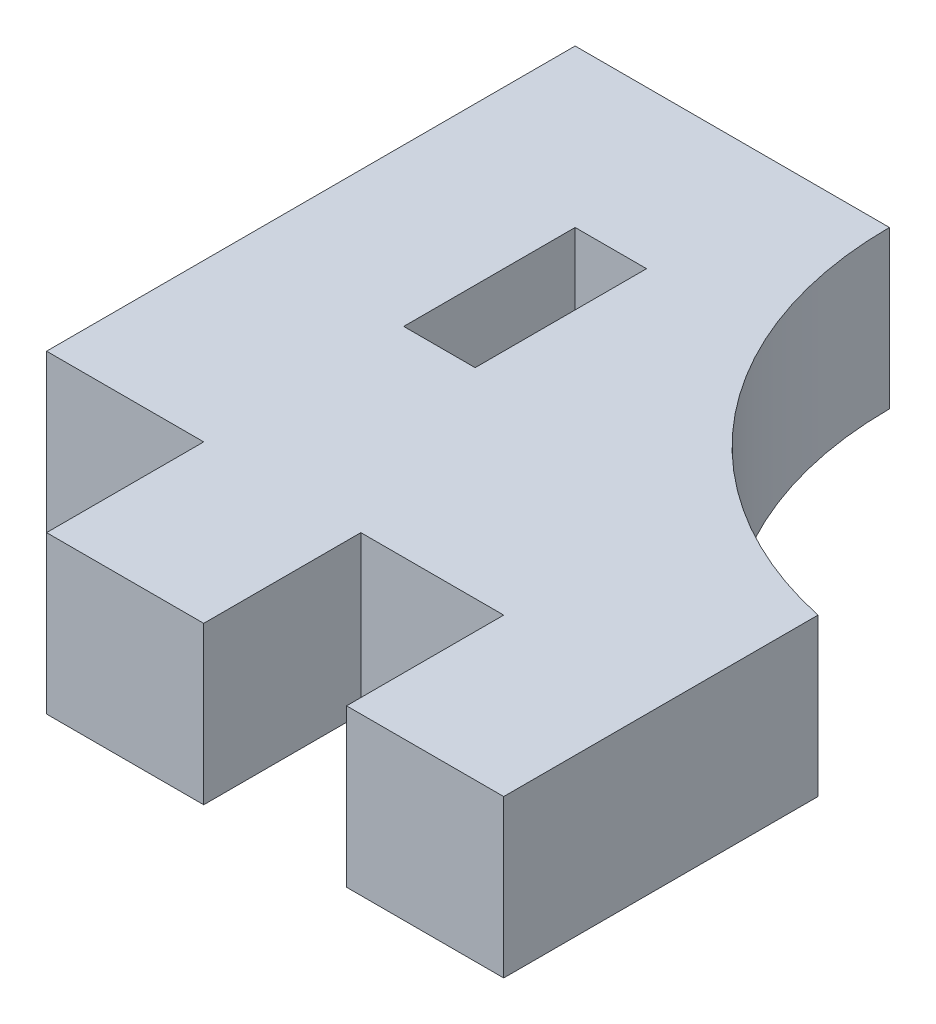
ISO-10303-21;
HEADER;
FILE_DESCRIPTION(('STEP AP214'),'2;1');
FILE_NAME('part.step','',(''),(''),'','','');
FILE_SCHEMA(('AUTOMOTIVE_DESIGN { 1 0 10303 214 1 1 1 1 }'));
ENDSEC;
DATA;
#1=APPLICATION_CONTEXT('core data for automotive mechanical design processes');
#2=APPLICATION_PROTOCOL_DEFINITION('international standard','automotive_design',2000,#1);
#3=PRODUCT_CONTEXT('',#1,'mechanical');
#4=PRODUCT('Part','Part','',(#3));
#5=PRODUCT_RELATED_PRODUCT_CATEGORY('part','',(#4));
#6=PRODUCT_DEFINITION_FORMATION('','',#4);
#7=PRODUCT_DEFINITION_CONTEXT('part definition',#1,'design');
#8=PRODUCT_DEFINITION('design','',#6,#7);
#9=PRODUCT_DEFINITION_SHAPE('','',#8);
#10=(LENGTH_UNIT() NAMED_UNIT(*) SI_UNIT(.MILLI.,.METRE.));
#11=(NAMED_UNIT(*) PLANE_ANGLE_UNIT() SI_UNIT($,.RADIAN.));
#12=(NAMED_UNIT(*) SI_UNIT($,.STERADIAN.) SOLID_ANGLE_UNIT());
#13=UNCERTAINTY_MEASURE_WITH_UNIT(LENGTH_MEASURE(1.E-05),#10,'distance_accuracy_value','');
#14=(GEOMETRIC_REPRESENTATION_CONTEXT(3) GLOBAL_UNCERTAINTY_ASSIGNED_CONTEXT((#13)) GLOBAL_UNIT_ASSIGNED_CONTEXT((#10,
#11,#12)) REPRESENTATION_CONTEXT('',''));
#15=CARTESIAN_POINT('',(0.,0.,0.));
#16=DIRECTION('',(0.,0.,1.));
#17=DIRECTION('',(1.,0.,0.));
#18=AXIS2_PLACEMENT_3D('',#15,#16,#17);
#19=CARTESIAN_POINT('',(2.79761904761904,5.5,-24.));
#20=DIRECTION('',(0.,1.,0.));
#21=DIRECTION('',(0.,0.,1.));
#22=AXIS2_PLACEMENT_3D('',#19,#20,#21);
#23=PLANE('',#22);
#24=DIRECTION('',(0.,0.,-1.));
#25=VECTOR('',#24,1.);
#26=CARTESIAN_POINT('',(0.,5.5,0.));
#27=LINE('',#26,#25);
#28=CARTESIAN_POINT('',(0.,5.5,0.));
#29=VERTEX_POINT('',#28);
#30=CARTESIAN_POINT('',(0.,5.5,-11.));
#31=VERTEX_POINT('',#30);
#32=EDGE_CURVE('E195',#29,#31,#27,.T.);
#33=ORIENTED_EDGE('',*,*,#32,.T.);
#34=CARTESIAN_POINT('',(2.79761904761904,5.5,-24.));
#35=DIRECTION('',(0.,-1.,0.));
#36=DIRECTION('',(0.,0.,1.));
#37=AXIS2_PLACEMENT_3D('',#34,#35,#36);
#38=CIRCLE('',#37,13.297619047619);
#39=CARTESIAN_POINT('',(-10.5,5.5,-24.));
#40=VERTEX_POINT('',#39);
#41=EDGE_CURVE('E198',#31,#40,#38,.T.);
#42=ORIENTED_EDGE('',*,*,#41,.T.);
#43=DIRECTION('',(-1.,0.,0.));
#44=VECTOR('',#43,1.);
#45=CARTESIAN_POINT('',(-10.5,5.5,-24.));
#46=LINE('',#45,#44);
#47=CARTESIAN_POINT('',(-21.5,5.5,-24.));
#48=VERTEX_POINT('',#47);
#49=EDGE_CURVE('E202',#40,#48,#46,.T.);
#50=ORIENTED_EDGE('',*,*,#49,.T.);
#51=DIRECTION('',(0.,0.,1.));
#52=VECTOR('',#51,1.);
#53=CARTESIAN_POINT('',(-21.5,5.5,-24.));
#54=LINE('',#53,#52);
#55=CARTESIAN_POINT('',(-21.5,5.5,-5.5));
#56=VERTEX_POINT('',#55);
#57=EDGE_CURVE('E205',#48,#56,#54,.T.);
#58=ORIENTED_EDGE('',*,*,#57,.T.);
#59=DIRECTION('',(1.,0.,0.));
#60=VECTOR('',#59,1.);
#61=CARTESIAN_POINT('',(-21.5,5.5,-5.5));
#62=LINE('',#61,#60);
#63=CARTESIAN_POINT('',(-16.,5.5,-5.5));
#64=VERTEX_POINT('',#63);
#65=EDGE_CURVE('E208',#56,#64,#62,.T.);
#66=ORIENTED_EDGE('',*,*,#65,.T.);
#67=DIRECTION('',(0.,0.,1.));
#68=VECTOR('',#67,1.);
#69=CARTESIAN_POINT('',(-16.,5.5,-5.5));
#70=LINE('',#69,#68);
#71=CARTESIAN_POINT('',(-16.,5.5,0.));
#72=VERTEX_POINT('',#71);
#73=EDGE_CURVE('E211',#64,#72,#70,.T.);
#74=ORIENTED_EDGE('',*,*,#73,.T.);
#75=DIRECTION('',(1.,0.,0.));
#76=VECTOR('',#75,1.);
#77=CARTESIAN_POINT('',(-16.,5.5,0.));
#78=LINE('',#77,#76);
#79=CARTESIAN_POINT('',(-10.5,5.5,0.));
#80=VERTEX_POINT('',#79);
#81=EDGE_CURVE('E214',#72,#80,#78,.T.);
#82=ORIENTED_EDGE('',*,*,#81,.T.);
#83=DIRECTION('',(0.,0.,-1.));
#84=VECTOR('',#83,1.);
#85=CARTESIAN_POINT('',(-10.5,5.5,0.));
#86=LINE('',#85,#84);
#87=CARTESIAN_POINT('',(-10.5,5.5,-5.5));
#88=VERTEX_POINT('',#87);
#89=EDGE_CURVE('E217',#80,#88,#86,.T.);
#90=ORIENTED_EDGE('',*,*,#89,.T.);
#91=DIRECTION('',(1.,0.,0.));
#92=VECTOR('',#91,1.);
#93=CARTESIAN_POINT('',(-10.5,5.5,-5.5));
#94=LINE('',#93,#92);
#95=CARTESIAN_POINT('',(-5.5,5.5,-5.5));
#96=VERTEX_POINT('',#95);
#97=EDGE_CURVE('E220',#88,#96,#94,.T.);
#98=ORIENTED_EDGE('',*,*,#97,.T.);
#99=DIRECTION('',(0.,0.,1.));
#100=VECTOR('',#99,1.);
#101=CARTESIAN_POINT('',(-5.5,5.5,-5.5));
#102=LINE('',#101,#100);
#103=CARTESIAN_POINT('',(-5.5,5.5,0.));
#104=VERTEX_POINT('',#103);
#105=EDGE_CURVE('E223',#96,#104,#102,.T.);
#106=ORIENTED_EDGE('',*,*,#105,.T.);
#107=DIRECTION('',(1.,0.,0.));
#108=VECTOR('',#107,1.);
#109=CARTESIAN_POINT('',(-5.5,5.5,0.));
#110=LINE('',#109,#108);
#111=EDGE_CURVE('E226',#104,#29,#110,.T.);
#112=ORIENTED_EDGE('',*,*,#111,.T.);
#113=EDGE_LOOP('',(#33,#42,#50,#58,#66,#74,#82,#90,#98,#106,#112));
#114=FACE_BOUND('',#113,.T.);
#115=DIRECTION('',(1.,0.,0.));
#116=VECTOR('',#115,1.);
#117=CARTESIAN_POINT('',(-13.5,5.5,-12.5));
#118=LINE('',#117,#116);
#119=CARTESIAN_POINT('',(-16.,5.5,-12.5));
#120=VERTEX_POINT('',#119);
#121=CARTESIAN_POINT('',(-13.5,5.5,-12.5));
#122=VERTEX_POINT('',#121);
#123=EDGE_CURVE('E156',#120,#122,#118,.T.);
#124=ORIENTED_EDGE('',*,*,#123,.F.);
#125=DIRECTION('',(0.,0.,1.));
#126=VECTOR('',#125,1.);
#127=CARTESIAN_POINT('',(-16.,5.5,-12.5));
#128=LINE('',#127,#126);
#129=CARTESIAN_POINT('',(-16.,5.5,-18.5));
#130=VERTEX_POINT('',#129);
#131=EDGE_CURVE('E147',#130,#120,#128,.T.);
#132=ORIENTED_EDGE('',*,*,#131,.F.);
#133=DIRECTION('',(-1.,0.,0.));
#134=VECTOR('',#133,1.);
#135=CARTESIAN_POINT('',(-16.,5.5,-18.5));
#136=LINE('',#135,#134);
#137=CARTESIAN_POINT('',(-13.5,5.5,-18.5));
#138=VERTEX_POINT('',#137);
#139=EDGE_CURVE('E173',#138,#130,#136,.T.);
#140=ORIENTED_EDGE('',*,*,#139,.F.);
#141=DIRECTION('',(0.,0.,-1.));
#142=VECTOR('',#141,1.);
#143=CARTESIAN_POINT('',(-13.5,5.5,-18.5));
#144=LINE('',#143,#142);
#145=EDGE_CURVE('E169',#122,#138,#144,.T.);
#146=ORIENTED_EDGE('',*,*,#145,.F.);
#147=EDGE_LOOP('',(#124,#132,#140,#146));
#148=FACE_BOUND('',#147,.T.);
#149=ADVANCED_FACE('F39',(#114,#148),#23,.T.);
#150=CARTESIAN_POINT('',(2.79761904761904,0.,-24.));
#151=DIRECTION('',(0.,1.,0.));
#152=DIRECTION('',(0.,0.,1.));
#153=AXIS2_PLACEMENT_3D('',#150,#151,#152);
#154=PLANE('',#153);
#155=DIRECTION('',(0.,0.,-1.));
#156=VECTOR('',#155,1.);
#157=CARTESIAN_POINT('',(0.,0.,-5.5));
#158=LINE('',#157,#156);
#159=CARTESIAN_POINT('',(0.,0.,0.));
#160=VERTEX_POINT('',#159);
#161=CARTESIAN_POINT('',(0.,0.,-11.));
#162=VERTEX_POINT('',#161);
#163=EDGE_CURVE('E165',#160,#162,#158,.T.);
#164=ORIENTED_EDGE('',*,*,#163,.F.);
#165=DIRECTION('',(1.,0.,0.));
#166=VECTOR('',#165,1.);
#167=CARTESIAN_POINT('',(-5.5,0.,0.));
#168=LINE('',#167,#166);
#169=CARTESIAN_POINT('',(-5.5,0.,0.));
#170=VERTEX_POINT('',#169);
#171=EDGE_CURVE('E199',#170,#160,#168,.T.);
#172=ORIENTED_EDGE('',*,*,#171,.F.);
#173=DIRECTION('',(0.,0.,1.));
#174=VECTOR('',#173,1.);
#175=CARTESIAN_POINT('',(-5.5,0.,-5.5));
#176=LINE('',#175,#174);
#177=CARTESIAN_POINT('',(-5.5,0.,-5.5));
#178=VERTEX_POINT('',#177);
#179=EDGE_CURVE('E256',#178,#170,#176,.T.);
#180=ORIENTED_EDGE('',*,*,#179,.F.);
#181=DIRECTION('',(1.,0.,0.));
#182=VECTOR('',#181,1.);
#183=CARTESIAN_POINT('',(-10.5,0.,-5.5));
#184=LINE('',#183,#182);
#185=CARTESIAN_POINT('',(-10.5,0.,-5.5));
#186=VERTEX_POINT('',#185);
#187=EDGE_CURVE('E253',#186,#178,#184,.T.);
#188=ORIENTED_EDGE('',*,*,#187,.F.);
#189=DIRECTION('',(0.,0.,-1.));
#190=VECTOR('',#189,1.);
#191=CARTESIAN_POINT('',(-10.5,0.,0.));
#192=LINE('',#191,#190);
#193=CARTESIAN_POINT('',(-10.5,0.,0.));
#194=VERTEX_POINT('',#193);
#195=EDGE_CURVE('E250',#194,#186,#192,.T.);
#196=ORIENTED_EDGE('',*,*,#195,.F.);
#197=DIRECTION('',(1.,0.,0.));
#198=VECTOR('',#197,1.);
#199=CARTESIAN_POINT('',(-16.,0.,0.));
#200=LINE('',#199,#198);
#201=CARTESIAN_POINT('',(-16.,0.,0.));
#202=VERTEX_POINT('',#201);
#203=EDGE_CURVE('E247',#202,#194,#200,.T.);
#204=ORIENTED_EDGE('',*,*,#203,.F.);
#205=DIRECTION('',(0.,0.,1.));
#206=VECTOR('',#205,1.);
#207=CARTESIAN_POINT('',(-16.,0.,-5.5));
#208=LINE('',#207,#206);
#209=CARTESIAN_POINT('',(-16.,0.,-5.5));
#210=VERTEX_POINT('',#209);
#211=EDGE_CURVE('E244',#210,#202,#208,.T.);
#212=ORIENTED_EDGE('',*,*,#211,.F.);
#213=DIRECTION('',(1.,0.,0.));
#214=VECTOR('',#213,1.);
#215=CARTESIAN_POINT('',(-21.5,0.,-5.5));
#216=LINE('',#215,#214);
#217=CARTESIAN_POINT('',(-21.5,0.,-5.5));
#218=VERTEX_POINT('',#217);
#219=EDGE_CURVE('E241',#218,#210,#216,.T.);
#220=ORIENTED_EDGE('',*,*,#219,.F.);
#221=DIRECTION('',(0.,0.,1.));
#222=VECTOR('',#221,1.);
#223=CARTESIAN_POINT('',(-21.5,0.,-24.));
#224=LINE('',#223,#222);
#225=CARTESIAN_POINT('',(-21.5,0.,-24.));
#226=VERTEX_POINT('',#225);
#227=EDGE_CURVE('E238',#226,#218,#224,.T.);
#228=ORIENTED_EDGE('',*,*,#227,.F.);
#229=DIRECTION('',(-1.,0.,0.));
#230=VECTOR('',#229,1.);
#231=CARTESIAN_POINT('',(-10.5,0.,-24.));
#232=LINE('',#231,#230);
#233=CARTESIAN_POINT('',(-10.5,0.,-24.));
#234=VERTEX_POINT('',#233);
#235=EDGE_CURVE('E235',#234,#226,#232,.T.);
#236=ORIENTED_EDGE('',*,*,#235,.F.);
#237=CARTESIAN_POINT('',(2.79761904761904,0.,-24.));
#238=DIRECTION('',(0.,-1.,0.));
#239=DIRECTION('',(0.,0.,1.));
#240=AXIS2_PLACEMENT_3D('',#237,#238,#239);
#241=CIRCLE('',#240,13.297619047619);
#242=EDGE_CURVE('E232',#162,#234,#241,.T.);
#243=ORIENTED_EDGE('',*,*,#242,.F.);
#244=EDGE_LOOP('',(#164,#172,#180,#188,#196,#204,#212,#220,#228,#236,#243));
#245=FACE_BOUND('',#244,.T.);
#246=DIRECTION('',(0.,0.,1.));
#247=VECTOR('',#246,1.);
#248=CARTESIAN_POINT('',(-16.,0.,-12.5));
#249=LINE('',#248,#247);
#250=CARTESIAN_POINT('',(-16.,0.,-18.5));
#251=VERTEX_POINT('',#250);
#252=CARTESIAN_POINT('',(-16.,0.,-12.5));
#253=VERTEX_POINT('',#252);
#254=EDGE_CURVE('E63',#251,#253,#249,.T.);
#255=ORIENTED_EDGE('',*,*,#254,.T.);
#256=DIRECTION('',(1.,0.,0.));
#257=VECTOR('',#256,1.);
#258=CARTESIAN_POINT('',(-13.5,0.,-12.5));
#259=LINE('',#258,#257);
#260=CARTESIAN_POINT('',(-13.5,0.,-12.5));
#261=VERTEX_POINT('',#260);
#262=EDGE_CURVE('E163',#253,#261,#259,.T.);
#263=ORIENTED_EDGE('',*,*,#262,.T.);
#264=DIRECTION('',(0.,0.,-1.));
#265=VECTOR('',#264,1.);
#266=CARTESIAN_POINT('',(-13.5,0.,-18.5));
#267=LINE('',#266,#265);
#268=CARTESIAN_POINT('',(-13.5,0.,-18.5));
#269=VERTEX_POINT('',#268);
#270=EDGE_CURVE('E182',#261,#269,#267,.T.);
#271=ORIENTED_EDGE('',*,*,#270,.T.);
#272=DIRECTION('',(-1.,0.,0.));
#273=VECTOR('',#272,1.);
#274=CARTESIAN_POINT('',(-16.,0.,-18.5));
#275=LINE('',#274,#273);
#276=EDGE_CURVE('E157',#269,#251,#275,.T.);
#277=ORIENTED_EDGE('',*,*,#276,.T.);
#278=EDGE_LOOP('',(#255,#263,#271,#277));
#279=FACE_BOUND('',#278,.T.);
#280=ADVANCED_FACE('F309',(#245,#279),#154,.F.);
#281=CARTESIAN_POINT('',(0.,5.5,-5.5));
#282=DIRECTION('',(-1.,0.,0.));
#283=DIRECTION('',(0.,0.,1.));
#284=AXIS2_PLACEMENT_3D('',#281,#282,#283);
#285=PLANE('',#284);
#286=ORIENTED_EDGE('',*,*,#163,.T.);
#287=DIRECTION('',(0.,-1.,0.));
#288=VECTOR('',#287,1.);
#289=CARTESIAN_POINT('',(0.,5.5,-11.));
#290=LINE('',#289,#288);
#291=EDGE_CURVE('E11',#31,#162,#290,.T.);
#292=ORIENTED_EDGE('',*,*,#291,.F.);
#293=ORIENTED_EDGE('',*,*,#32,.F.);
#294=DIRECTION('',(0.,-1.,0.));
#295=VECTOR('',#294,1.);
#296=CARTESIAN_POINT('',(0.,5.5,0.));
#297=LINE('',#296,#295);
#298=EDGE_CURVE('E229',#29,#160,#297,.T.);
#299=ORIENTED_EDGE('',*,*,#298,.T.);
#300=EDGE_LOOP('',(#286,#292,#293,#299));
#301=FACE_BOUND('',#300,.T.);
#302=ADVANCED_FACE('F41',(#301),#285,.F.);
#303=CARTESIAN_POINT('',(2.79761904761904,5.5,-24.));
#304=DIRECTION('',(0.,-1.,0.));
#305=DIRECTION('',(0.,0.,-1.));
#306=AXIS2_PLACEMENT_3D('',#303,#304,#305);
#307=CYLINDRICAL_SURFACE('',#306,13.297619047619);
#308=ORIENTED_EDGE('',*,*,#242,.T.);
#309=DIRECTION('',(0.,-1.,0.));
#310=VECTOR('',#309,1.);
#311=CARTESIAN_POINT('',(-10.5,5.5,-24.));
#312=LINE('',#311,#310);
#313=EDGE_CURVE('E48',#40,#234,#312,.T.);
#314=ORIENTED_EDGE('',*,*,#313,.F.);
#315=ORIENTED_EDGE('',*,*,#41,.F.);
#316=ORIENTED_EDGE('',*,*,#291,.T.);
#317=EDGE_LOOP('',(#308,#314,#315,#316));
#318=FACE_BOUND('',#317,.T.);
#319=ADVANCED_FACE('F326',(#318),#307,.F.);
#320=CARTESIAN_POINT('',(-10.5,5.5,-24.));
#321=DIRECTION('',(0.,0.,1.));
#322=DIRECTION('',(1.,0.,0.));
#323=AXIS2_PLACEMENT_3D('',#320,#321,#322);
#324=PLANE('',#323);
#325=ORIENTED_EDGE('',*,*,#235,.T.);
#326=DIRECTION('',(0.,-1.,0.));
#327=VECTOR('',#326,1.);
#328=CARTESIAN_POINT('',(-21.5,5.5,-24.));
#329=LINE('',#328,#327);
#330=EDGE_CURVE('E293',#48,#226,#329,.T.);
#331=ORIENTED_EDGE('',*,*,#330,.F.);
#332=ORIENTED_EDGE('',*,*,#49,.F.);
#333=ORIENTED_EDGE('',*,*,#313,.T.);
#334=EDGE_LOOP('',(#325,#331,#332,#333));
#335=FACE_BOUND('',#334,.T.);
#336=ADVANCED_FACE('F302',(#335),#324,.F.);
#337=CARTESIAN_POINT('',(-21.5,5.5,-24.));
#338=DIRECTION('',(1.,0.,0.));
#339=DIRECTION('',(0.,0.,-1.));
#340=AXIS2_PLACEMENT_3D('',#337,#338,#339);
#341=PLANE('',#340);
#342=ORIENTED_EDGE('',*,*,#227,.T.);
#343=DIRECTION('',(0.,-1.,0.));
#344=VECTOR('',#343,1.);
#345=CARTESIAN_POINT('',(-21.5,5.5,-5.5));
#346=LINE('',#345,#344);
#347=EDGE_CURVE('E289',#56,#218,#346,.T.);
#348=ORIENTED_EDGE('',*,*,#347,.F.);
#349=ORIENTED_EDGE('',*,*,#57,.F.);
#350=ORIENTED_EDGE('',*,*,#330,.T.);
#351=EDGE_LOOP('',(#342,#348,#349,#350));
#352=FACE_BOUND('',#351,.T.);
#353=ADVANCED_FACE('F315',(#352),#341,.F.);
#354=CARTESIAN_POINT('',(-21.5,5.5,-5.5));
#355=DIRECTION('',(0.,0.,-1.));
#356=DIRECTION('',(-1.,0.,0.));
#357=AXIS2_PLACEMENT_3D('',#354,#355,#356);
#358=PLANE('',#357);
#359=ORIENTED_EDGE('',*,*,#219,.T.);
#360=DIRECTION('',(0.,-1.,0.));
#361=VECTOR('',#360,1.);
#362=CARTESIAN_POINT('',(-16.,5.5,-5.5));
#363=LINE('',#362,#361);
#364=EDGE_CURVE('E285',#64,#210,#363,.T.);
#365=ORIENTED_EDGE('',*,*,#364,.F.);
#366=ORIENTED_EDGE('',*,*,#65,.F.);
#367=ORIENTED_EDGE('',*,*,#347,.T.);
#368=EDGE_LOOP('',(#359,#365,#366,#367));
#369=FACE_BOUND('',#368,.T.);
#370=ADVANCED_FACE('F319',(#369),#358,.F.);
#371=CARTESIAN_POINT('',(-16.,5.5,-5.5));
#372=DIRECTION('',(1.,0.,0.));
#373=DIRECTION('',(0.,0.,-1.));
#374=AXIS2_PLACEMENT_3D('',#371,#372,#373);
#375=PLANE('',#374);
#376=ORIENTED_EDGE('',*,*,#211,.T.);
#377=DIRECTION('',(0.,-1.,0.));
#378=VECTOR('',#377,1.);
#379=CARTESIAN_POINT('',(-16.,5.5,0.));
#380=LINE('',#379,#378);
#381=EDGE_CURVE('E281',#72,#202,#380,.T.);
#382=ORIENTED_EDGE('',*,*,#381,.F.);
#383=ORIENTED_EDGE('',*,*,#73,.F.);
#384=ORIENTED_EDGE('',*,*,#364,.T.);
#385=EDGE_LOOP('',(#376,#382,#383,#384));
#386=FACE_BOUND('',#385,.T.);
#387=ADVANCED_FACE('F354',(#386),#375,.F.);
#388=CARTESIAN_POINT('',(-16.,5.5,0.));
#389=DIRECTION('',(0.,0.,-1.));
#390=DIRECTION('',(-1.,0.,0.));
#391=AXIS2_PLACEMENT_3D('',#388,#389,#390);
#392=PLANE('',#391);
#393=ORIENTED_EDGE('',*,*,#203,.T.);
#394=DIRECTION('',(0.,-1.,0.));
#395=VECTOR('',#394,1.);
#396=CARTESIAN_POINT('',(-10.5,5.5,0.));
#397=LINE('',#396,#395);
#398=EDGE_CURVE('E277',#80,#194,#397,.T.);
#399=ORIENTED_EDGE('',*,*,#398,.F.);
#400=ORIENTED_EDGE('',*,*,#81,.F.);
#401=ORIENTED_EDGE('',*,*,#381,.T.);
#402=EDGE_LOOP('',(#393,#399,#400,#401));
#403=FACE_BOUND('',#402,.T.);
#404=ADVANCED_FACE('F352',(#403),#392,.F.);
#405=CARTESIAN_POINT('',(-10.5,5.5,0.));
#406=DIRECTION('',(-1.,0.,0.));
#407=DIRECTION('',(0.,0.,1.));
#408=AXIS2_PLACEMENT_3D('',#405,#406,#407);
#409=PLANE('',#408);
#410=ORIENTED_EDGE('',*,*,#195,.T.);
#411=DIRECTION('',(0.,-1.,0.));
#412=VECTOR('',#411,1.);
#413=CARTESIAN_POINT('',(-10.5,5.5,-5.5));
#414=LINE('',#413,#412);
#415=EDGE_CURVE('E273',#88,#186,#414,.T.);
#416=ORIENTED_EDGE('',*,*,#415,.F.);
#417=ORIENTED_EDGE('',*,*,#89,.F.);
#418=ORIENTED_EDGE('',*,*,#398,.T.);
#419=EDGE_LOOP('',(#410,#416,#417,#418));
#420=FACE_BOUND('',#419,.T.);
#421=ADVANCED_FACE('F348',(#420),#409,.F.);
#422=CARTESIAN_POINT('',(-10.5,5.5,-5.5));
#423=DIRECTION('',(0.,0.,-1.));
#424=DIRECTION('',(-1.,0.,0.));
#425=AXIS2_PLACEMENT_3D('',#422,#423,#424);
#426=PLANE('',#425);
#427=ORIENTED_EDGE('',*,*,#187,.T.);
#428=DIRECTION('',(0.,-1.,0.));
#429=VECTOR('',#428,1.);
#430=CARTESIAN_POINT('',(-5.5,5.5,-5.5));
#431=LINE('',#430,#429);
#432=EDGE_CURVE('E269',#96,#178,#431,.T.);
#433=ORIENTED_EDGE('',*,*,#432,.F.);
#434=ORIENTED_EDGE('',*,*,#97,.F.);
#435=ORIENTED_EDGE('',*,*,#415,.T.);
#436=EDGE_LOOP('',(#427,#433,#434,#435));
#437=FACE_BOUND('',#436,.T.);
#438=ADVANCED_FACE('F343',(#437),#426,.F.);
#439=CARTESIAN_POINT('',(-5.5,5.5,-5.5));
#440=DIRECTION('',(1.,0.,0.));
#441=DIRECTION('',(0.,0.,-1.));
#442=AXIS2_PLACEMENT_3D('',#439,#440,#441);
#443=PLANE('',#442);
#444=ORIENTED_EDGE('',*,*,#179,.T.);
#445=DIRECTION('',(0.,-1.,0.));
#446=VECTOR('',#445,1.);
#447=CARTESIAN_POINT('',(-5.5,5.5,0.));
#448=LINE('',#447,#446);
#449=EDGE_CURVE('E265',#104,#170,#448,.T.);
#450=ORIENTED_EDGE('',*,*,#449,.F.);
#451=ORIENTED_EDGE('',*,*,#105,.F.);
#452=ORIENTED_EDGE('',*,*,#432,.T.);
#453=EDGE_LOOP('',(#444,#450,#451,#452));
#454=FACE_BOUND('',#453,.T.);
#455=ADVANCED_FACE('F337',(#454),#443,.F.);
#456=CARTESIAN_POINT('',(-5.5,5.5,0.));
#457=DIRECTION('',(0.,0.,-1.));
#458=DIRECTION('',(-1.,0.,0.));
#459=AXIS2_PLACEMENT_3D('',#456,#457,#458);
#460=PLANE('',#459);
#461=ORIENTED_EDGE('',*,*,#171,.T.);
#462=ORIENTED_EDGE('',*,*,#298,.F.);
#463=ORIENTED_EDGE('',*,*,#111,.F.);
#464=ORIENTED_EDGE('',*,*,#449,.T.);
#465=EDGE_LOOP('',(#461,#462,#463,#464));
#466=FACE_BOUND('',#465,.T.);
#467=ADVANCED_FACE('F332',(#466),#460,.F.);
#468=CARTESIAN_POINT('',(-16.,5.5,-12.5));
#469=DIRECTION('',(1.,0.,0.));
#470=DIRECTION('',(0.,0.,-1.));
#471=AXIS2_PLACEMENT_3D('',#468,#469,#470);
#472=PLANE('',#471);
#473=ORIENTED_EDGE('',*,*,#254,.F.);
#474=DIRECTION('',(0.,-1.,0.));
#475=VECTOR('',#474,1.);
#476=CARTESIAN_POINT('',(-16.,5.5,-18.5));
#477=LINE('',#476,#475);
#478=EDGE_CURVE('E151',#130,#251,#477,.T.);
#479=ORIENTED_EDGE('',*,*,#478,.F.);
#480=ORIENTED_EDGE('',*,*,#131,.T.);
#481=DIRECTION('',(0.,-1.,0.));
#482=VECTOR('',#481,1.);
#483=CARTESIAN_POINT('',(-16.,5.5,-12.5));
#484=LINE('',#483,#482);
#485=EDGE_CURVE('E150',#120,#253,#484,.T.);
#486=ORIENTED_EDGE('',*,*,#485,.T.);
#487=EDGE_LOOP('',(#473,#479,#480,#486));
#488=FACE_BOUND('',#487,.T.);
#489=ADVANCED_FACE('F149',(#488),#472,.T.);
#490=CARTESIAN_POINT('',(-13.5,5.5,-12.5));
#491=DIRECTION('',(0.,0.,-1.));
#492=DIRECTION('',(-1.,0.,0.));
#493=AXIS2_PLACEMENT_3D('',#490,#491,#492);
#494=PLANE('',#493);
#495=ORIENTED_EDGE('',*,*,#262,.F.);
#496=ORIENTED_EDGE('',*,*,#485,.F.);
#497=ORIENTED_EDGE('',*,*,#123,.T.);
#498=DIRECTION('',(0.,-1.,0.));
#499=VECTOR('',#498,1.);
#500=CARTESIAN_POINT('',(-13.5,5.5,-12.5));
#501=LINE('',#500,#499);
#502=EDGE_CURVE('E166',#122,#261,#501,.T.);
#503=ORIENTED_EDGE('',*,*,#502,.T.);
#504=EDGE_LOOP('',(#495,#496,#497,#503));
#505=FACE_BOUND('',#504,.T.);
#506=ADVANCED_FACE('F160',(#505),#494,.T.);
#507=CARTESIAN_POINT('',(-13.5,5.5,-18.5));
#508=DIRECTION('',(-1.,0.,0.));
#509=DIRECTION('',(0.,0.,1.));
#510=AXIS2_PLACEMENT_3D('',#507,#508,#509);
#511=PLANE('',#510);
#512=ORIENTED_EDGE('',*,*,#270,.F.);
#513=ORIENTED_EDGE('',*,*,#502,.F.);
#514=ORIENTED_EDGE('',*,*,#145,.T.);
#515=DIRECTION('',(0.,-1.,0.));
#516=VECTOR('',#515,1.);
#517=CARTESIAN_POINT('',(-13.5,5.5,-18.5));
#518=LINE('',#517,#516);
#519=EDGE_CURVE('E55',#138,#269,#518,.T.);
#520=ORIENTED_EDGE('',*,*,#519,.T.);
#521=EDGE_LOOP('',(#512,#513,#514,#520));
#522=FACE_BOUND('',#521,.T.);
#523=ADVANCED_FACE('F406',(#522),#511,.T.);
#524=CARTESIAN_POINT('',(-16.,5.5,-18.5));
#525=DIRECTION('',(0.,0.,1.));
#526=DIRECTION('',(1.,0.,0.));
#527=AXIS2_PLACEMENT_3D('',#524,#525,#526);
#528=PLANE('',#527);
#529=ORIENTED_EDGE('',*,*,#276,.F.);
#530=ORIENTED_EDGE('',*,*,#519,.F.);
#531=ORIENTED_EDGE('',*,*,#139,.T.);
#532=ORIENTED_EDGE('',*,*,#478,.T.);
#533=EDGE_LOOP('',(#529,#530,#531,#532));
#534=FACE_BOUND('',#533,.T.);
#535=ADVANCED_FACE('F412',(#534),#528,.T.);
#536=CLOSED_SHELL('',(#149,#280,#302,#319,#336,#353,#370,#387,#404,#421,#438,#455,#467,#489,
#506,#523,#535));
#537=MANIFOLD_SOLID_BREP('B2',#536);
#538=ADVANCED_BREP_SHAPE_REPRESENTATION('',(#18,#537),#14);
#539=SHAPE_DEFINITION_REPRESENTATION(#9,#538);
ENDSEC;
END-ISO-10303-21;
